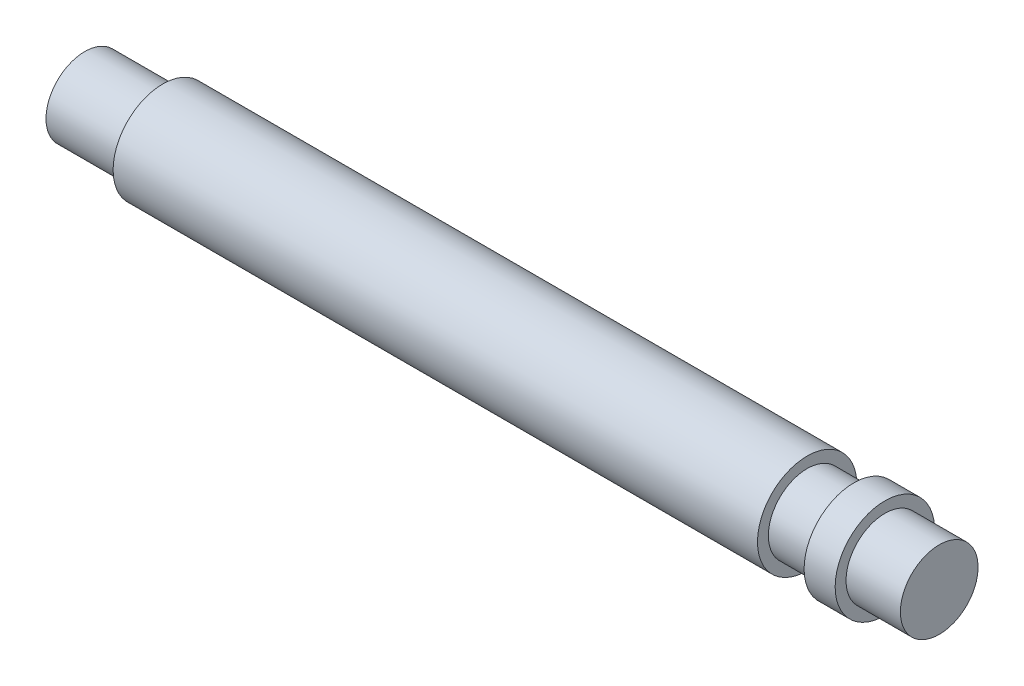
ISO-10303-21;
HEADER;
FILE_DESCRIPTION(('STEP AP214'),'2;1');
FILE_NAME('part.step','',(''),(''),'','','');
FILE_SCHEMA(('AUTOMOTIVE_DESIGN { 1 0 10303 214 1 1 1 1 }'));
ENDSEC;
DATA;
#1=APPLICATION_CONTEXT('core data for automotive mechanical design processes');
#2=APPLICATION_PROTOCOL_DEFINITION('international standard','automotive_design',2000,#1);
#3=PRODUCT_CONTEXT('',#1,'mechanical');
#4=PRODUCT('Part','Part','',(#3));
#5=PRODUCT_RELATED_PRODUCT_CATEGORY('part','',(#4));
#6=PRODUCT_DEFINITION_FORMATION('','',#4);
#7=PRODUCT_DEFINITION_CONTEXT('part definition',#1,'design');
#8=PRODUCT_DEFINITION('design','',#6,#7);
#9=PRODUCT_DEFINITION_SHAPE('','',#8);
#10=(LENGTH_UNIT() NAMED_UNIT(*) SI_UNIT(.MILLI.,.METRE.));
#11=(NAMED_UNIT(*) PLANE_ANGLE_UNIT() SI_UNIT($,.RADIAN.));
#12=(NAMED_UNIT(*) SI_UNIT($,.STERADIAN.) SOLID_ANGLE_UNIT());
#13=UNCERTAINTY_MEASURE_WITH_UNIT(LENGTH_MEASURE(1.E-05),#10,'distance_accuracy_value','');
#14=(GEOMETRIC_REPRESENTATION_CONTEXT(3) GLOBAL_UNCERTAINTY_ASSIGNED_CONTEXT((#13)) GLOBAL_UNIT_ASSIGNED_CONTEXT((#10,
#11,#12)) REPRESENTATION_CONTEXT('',''));
#15=CARTESIAN_POINT('',(0.,0.,0.));
#16=DIRECTION('',(0.,0.,1.));
#17=DIRECTION('',(1.,0.,0.));
#18=AXIS2_PLACEMENT_3D('',#15,#16,#17);
#19=CARTESIAN_POINT('',(0.,0.,0.));
#20=DIRECTION('',(-1.,0.,0.));
#21=DIRECTION('',(0.,0.,1.));
#22=AXIS2_PLACEMENT_3D('',#19,#20,#21);
#23=PLANE('',#22);
#24=CARTESIAN_POINT('',(0.,0.,0.));
#25=DIRECTION('',(-1.,0.,0.));
#26=DIRECTION('',(0.,0.,1.));
#27=AXIS2_PLACEMENT_3D('',#24,#25,#26);
#28=CIRCLE('',#27,6.35000000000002);
#29=CARTESIAN_POINT('',(0.,0.,6.35000000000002));
#30=VERTEX_POINT('',#29);
#31=EDGE_CURVE('E10',#30,#30,#28,.T.);
#32=ORIENTED_EDGE('',*,*,#31,.F.);
#33=EDGE_LOOP('',(#32));
#34=FACE_BOUND('',#33,.T.);
#35=ADVANCED_FACE('F30',(#34),#23,.F.);
#36=CARTESIAN_POINT('',(-139.7,0.,0.));
#37=DIRECTION('',(-1.,0.,0.));
#38=DIRECTION('',(0.,0.,1.));
#39=AXIS2_PLACEMENT_3D('',#36,#37,#38);
#40=CYLINDRICAL_SURFACE('',#39,6.35000000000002);
#41=CARTESIAN_POINT('',(-8.89000000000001,0.,0.));
#42=DIRECTION('',(-1.,0.,0.));
#43=DIRECTION('',(0.,0.,1.));
#44=AXIS2_PLACEMENT_3D('',#41,#42,#43);
#45=CIRCLE('',#44,6.35000000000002);
#46=CARTESIAN_POINT('',(-8.89000000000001,0.,6.35000000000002));
#47=VERTEX_POINT('',#46);
#48=EDGE_CURVE('E36',#47,#47,#45,.T.);
#49=ORIENTED_EDGE('',*,*,#48,.F.);
#50=EDGE_LOOP('',(#49));
#51=FACE_BOUND('',#50,.T.);
#52=ORIENTED_EDGE('',*,*,#31,.T.);
#53=EDGE_LOOP('',(#52));
#54=FACE_BOUND('',#53,.T.);
#55=ADVANCED_FACE('F114',(#51,#54),#40,.T.);
#56=CARTESIAN_POINT('',(-8.89,6.35000000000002,0.));
#57=DIRECTION('',(-1.,0.,0.));
#58=DIRECTION('',(0.,0.,1.));
#59=AXIS2_PLACEMENT_3D('',#56,#57,#58);
#60=PLANE('',#59);
#61=CARTESIAN_POINT('',(-8.89000000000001,0.,0.));
#62=DIRECTION('',(-1.,0.,0.));
#63=DIRECTION('',(0.,0.,1.));
#64=AXIS2_PLACEMENT_3D('',#61,#62,#63);
#65=CIRCLE('',#64,8.12800000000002);
#66=CARTESIAN_POINT('',(-8.89000000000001,0.,8.12800000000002));
#67=VERTEX_POINT('',#66);
#68=EDGE_CURVE('E40',#67,#67,#65,.T.);
#69=ORIENTED_EDGE('',*,*,#68,.F.);
#70=EDGE_LOOP('',(#69));
#71=FACE_BOUND('',#70,.T.);
#72=ORIENTED_EDGE('',*,*,#48,.T.);
#73=EDGE_LOOP('',(#72));
#74=FACE_BOUND('',#73,.T.);
#75=ADVANCED_FACE('F109',(#71,#74),#60,.F.);
#76=CARTESIAN_POINT('',(-139.7,0.,0.));
#77=DIRECTION('',(-1.,0.,0.));
#78=DIRECTION('',(0.,0.,1.));
#79=AXIS2_PLACEMENT_3D('',#76,#77,#78);
#80=CYLINDRICAL_SURFACE('',#79,8.12800000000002);
#81=CARTESIAN_POINT('',(-13.97,0.,0.));
#82=DIRECTION('',(-1.,0.,0.));
#83=DIRECTION('',(0.,0.,1.));
#84=AXIS2_PLACEMENT_3D('',#81,#82,#83);
#85=CIRCLE('',#84,8.12800000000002);
#86=CARTESIAN_POINT('',(-13.97,0.,8.12800000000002));
#87=VERTEX_POINT('',#86);
#88=EDGE_CURVE('E44',#87,#87,#85,.T.);
#89=ORIENTED_EDGE('',*,*,#88,.F.);
#90=EDGE_LOOP('',(#89));
#91=FACE_BOUND('',#90,.T.);
#92=ORIENTED_EDGE('',*,*,#68,.T.);
#93=EDGE_LOOP('',(#92));
#94=FACE_BOUND('',#93,.T.);
#95=ADVANCED_FACE('F103',(#91,#94),#80,.T.);
#96=CARTESIAN_POINT('',(-13.97,8.12800000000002,0.));
#97=DIRECTION('',(1.,0.,0.));
#98=DIRECTION('',(0.,0.,-1.));
#99=AXIS2_PLACEMENT_3D('',#96,#97,#98);
#100=PLANE('',#99);
#101=CARTESIAN_POINT('',(-13.97,0.,0.));
#102=DIRECTION('',(-1.,0.,0.));
#103=DIRECTION('',(0.,0.,1.));
#104=AXIS2_PLACEMENT_3D('',#101,#102,#103);
#105=CIRCLE('',#104,6.35000000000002);
#106=CARTESIAN_POINT('',(-13.97,0.,6.35000000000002));
#107=VERTEX_POINT('',#106);
#108=EDGE_CURVE('E49',#107,#107,#105,.T.);
#109=ORIENTED_EDGE('',*,*,#108,.F.);
#110=EDGE_LOOP('',(#109));
#111=FACE_BOUND('',#110,.T.);
#112=ORIENTED_EDGE('',*,*,#88,.T.);
#113=EDGE_LOOP('',(#112));
#114=FACE_BOUND('',#113,.T.);
#115=ADVANCED_FACE('F97',(#111,#114),#100,.F.);
#116=CARTESIAN_POINT('',(-139.7,0.,0.));
#117=DIRECTION('',(-1.,0.,0.));
#118=DIRECTION('',(0.,0.,1.));
#119=AXIS2_PLACEMENT_3D('',#116,#117,#118);
#120=CYLINDRICAL_SURFACE('',#119,6.35000000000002);
#121=CARTESIAN_POINT('',(-21.59,0.,0.));
#122=DIRECTION('',(-1.,0.,0.));
#123=DIRECTION('',(0.,0.,1.));
#124=AXIS2_PLACEMENT_3D('',#121,#122,#123);
#125=CIRCLE('',#124,6.35000000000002);
#126=CARTESIAN_POINT('',(-21.59,0.,6.35000000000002));
#127=VERTEX_POINT('',#126);
#128=EDGE_CURVE('E52',#127,#127,#125,.T.);
#129=ORIENTED_EDGE('',*,*,#128,.F.);
#130=EDGE_LOOP('',(#129));
#131=FACE_BOUND('',#130,.T.);
#132=ORIENTED_EDGE('',*,*,#108,.T.);
#133=EDGE_LOOP('',(#132));
#134=FACE_BOUND('',#133,.T.);
#135=ADVANCED_FACE('F91',(#131,#134),#120,.T.);
#136=CARTESIAN_POINT('',(-21.59,6.35000000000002,0.));
#137=DIRECTION('',(-1.,0.,0.));
#138=DIRECTION('',(0.,0.,1.));
#139=AXIS2_PLACEMENT_3D('',#136,#137,#138);
#140=PLANE('',#139);
#141=CARTESIAN_POINT('',(-21.59,0.,0.));
#142=DIRECTION('',(-1.,0.,0.));
#143=DIRECTION('',(0.,0.,1.));
#144=AXIS2_PLACEMENT_3D('',#141,#142,#143);
#145=CIRCLE('',#144,8.12800000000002);
#146=CARTESIAN_POINT('',(-21.59,0.,8.12800000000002));
#147=VERTEX_POINT('',#146);
#148=EDGE_CURVE('E55',#147,#147,#145,.T.);
#149=ORIENTED_EDGE('',*,*,#148,.F.);
#150=EDGE_LOOP('',(#149));
#151=FACE_BOUND('',#150,.T.);
#152=ORIENTED_EDGE('',*,*,#128,.T.);
#153=EDGE_LOOP('',(#152));
#154=FACE_BOUND('',#153,.T.);
#155=ADVANCED_FACE('F85',(#151,#154),#140,.F.);
#156=CARTESIAN_POINT('',(-139.7,0.,0.));
#157=DIRECTION('',(-1.,0.,0.));
#158=DIRECTION('',(0.,0.,1.));
#159=AXIS2_PLACEMENT_3D('',#156,#157,#158);
#160=CYLINDRICAL_SURFACE('',#159,8.12800000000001);
#161=CARTESIAN_POINT('',(-126.950325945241,0.,0.));
#162=DIRECTION('',(-1.,0.,0.));
#163=DIRECTION('',(0.,0.,1.));
#164=AXIS2_PLACEMENT_3D('',#161,#162,#163);
#165=CIRCLE('',#164,8.128);
#166=CARTESIAN_POINT('',(-126.950325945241,0.,8.128));
#167=VERTEX_POINT('',#166);
#168=EDGE_CURVE('E58',#167,#167,#165,.T.);
#169=ORIENTED_EDGE('',*,*,#168,.F.);
#170=EDGE_LOOP('',(#169));
#171=FACE_BOUND('',#170,.T.);
#172=ORIENTED_EDGE('',*,*,#148,.T.);
#173=EDGE_LOOP('',(#172));
#174=FACE_BOUND('',#173,.T.);
#175=ADVANCED_FACE('F79',(#171,#174),#160,.T.);
#176=CARTESIAN_POINT('',(-126.950325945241,8.128,0.));
#177=DIRECTION('',(1.,0.,0.));
#178=DIRECTION('',(0.,0.,-1.));
#179=AXIS2_PLACEMENT_3D('',#176,#177,#178);
#180=PLANE('',#179);
#181=CARTESIAN_POINT('',(-126.950325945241,0.,0.));
#182=DIRECTION('',(-1.,0.,0.));
#183=DIRECTION('',(0.,0.,1.));
#184=AXIS2_PLACEMENT_3D('',#181,#182,#183);
#185=CIRCLE('',#184,6.35);
#186=CARTESIAN_POINT('',(-126.950325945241,0.,6.35));
#187=VERTEX_POINT('',#186);
#188=EDGE_CURVE('E61',#187,#187,#185,.T.);
#189=ORIENTED_EDGE('',*,*,#188,.F.);
#190=EDGE_LOOP('',(#189));
#191=FACE_BOUND('',#190,.T.);
#192=ORIENTED_EDGE('',*,*,#168,.T.);
#193=EDGE_LOOP('',(#192));
#194=FACE_BOUND('',#193,.T.);
#195=ADVANCED_FACE('F73',(#191,#194),#180,.F.);
#196=CARTESIAN_POINT('',(-139.7,0.,0.));
#197=DIRECTION('',(-1.,0.,0.));
#198=DIRECTION('',(0.,0.,1.));
#199=AXIS2_PLACEMENT_3D('',#196,#197,#198);
#200=CYLINDRICAL_SURFACE('',#199,6.35);
#201=CARTESIAN_POINT('',(-139.7,0.,0.));
#202=DIRECTION('',(-1.,0.,0.));
#203=DIRECTION('',(0.,0.,1.));
#204=AXIS2_PLACEMENT_3D('',#201,#202,#203);
#205=CIRCLE('',#204,6.35);
#206=CARTESIAN_POINT('',(-139.7,0.,6.35));
#207=VERTEX_POINT('',#206);
#208=EDGE_CURVE('E64',#207,#207,#205,.T.);
#209=ORIENTED_EDGE('',*,*,#208,.F.);
#210=EDGE_LOOP('',(#209));
#211=FACE_BOUND('',#210,.T.);
#212=ORIENTED_EDGE('',*,*,#188,.T.);
#213=EDGE_LOOP('',(#212));
#214=FACE_BOUND('',#213,.T.);
#215=ADVANCED_FACE('F70',(#211,#214),#200,.T.);
#216=CARTESIAN_POINT('',(-139.7,6.35,0.));
#217=DIRECTION('',(1.,0.,0.));
#218=DIRECTION('',(0.,0.,-1.));
#219=AXIS2_PLACEMENT_3D('',#216,#217,#218);
#220=PLANE('',#219);
#221=ORIENTED_EDGE('',*,*,#208,.T.);
#222=EDGE_LOOP('',(#221));
#223=FACE_BOUND('',#222,.T.);
#224=ADVANCED_FACE('F68',(#223),#220,.F.);
#225=CLOSED_SHELL('',(#35,#55,#75,#95,#115,#135,#155,#175,#195,#215,#224));
#226=MANIFOLD_SOLID_BREP('B2',#225);
#227=ADVANCED_BREP_SHAPE_REPRESENTATION('',(#18,#226),#14);
#228=SHAPE_DEFINITION_REPRESENTATION(#9,#227);
ENDSEC;
END-ISO-10303-21;
